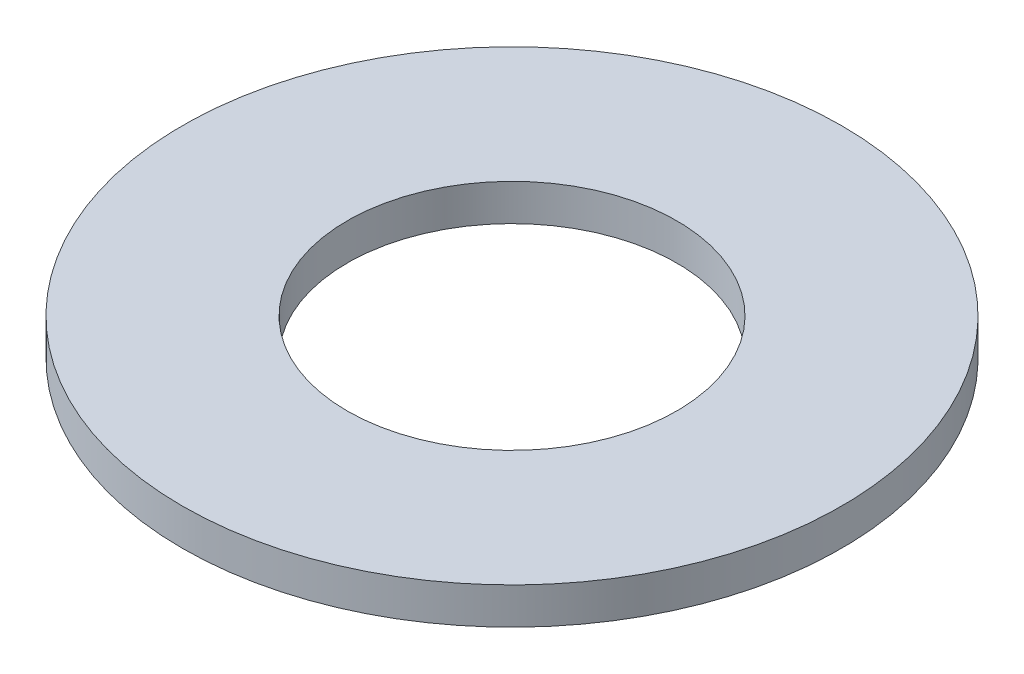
ISO-10303-21;
HEADER;
FILE_DESCRIPTION(('STEP AP214'),'2;1');
FILE_NAME('part.step','',(''),(''),'','','');
FILE_SCHEMA(('AUTOMOTIVE_DESIGN { 1 0 10303 214 1 1 1 1 }'));
ENDSEC;
DATA;
#1=APPLICATION_CONTEXT('core data for automotive mechanical design processes');
#2=APPLICATION_PROTOCOL_DEFINITION('international standard','automotive_design',2000,#1);
#3=PRODUCT_CONTEXT('',#1,'mechanical');
#4=PRODUCT('Part','Part','',(#3));
#5=PRODUCT_RELATED_PRODUCT_CATEGORY('part','',(#4));
#6=PRODUCT_DEFINITION_FORMATION('','',#4);
#7=PRODUCT_DEFINITION_CONTEXT('part definition',#1,'design');
#8=PRODUCT_DEFINITION('design','',#6,#7);
#9=PRODUCT_DEFINITION_SHAPE('','',#8);
#10=(LENGTH_UNIT() NAMED_UNIT(*) SI_UNIT(.MILLI.,.METRE.));
#11=(NAMED_UNIT(*) PLANE_ANGLE_UNIT() SI_UNIT($,.RADIAN.));
#12=(NAMED_UNIT(*) SI_UNIT($,.STERADIAN.) SOLID_ANGLE_UNIT());
#13=UNCERTAINTY_MEASURE_WITH_UNIT(LENGTH_MEASURE(1.E-05),#10,'distance_accuracy_value','');
#14=(GEOMETRIC_REPRESENTATION_CONTEXT(3) GLOBAL_UNCERTAINTY_ASSIGNED_CONTEXT((#13)) GLOBAL_UNIT_ASSIGNED_CONTEXT((#10,
#11,#12)) REPRESENTATION_CONTEXT('',''));
#15=CARTESIAN_POINT('',(0.,0.,0.));
#16=DIRECTION('',(0.,0.,1.));
#17=DIRECTION('',(1.,0.,0.));
#18=AXIS2_PLACEMENT_3D('',#15,#16,#17);
#19=CARTESIAN_POINT('',(0.,0.5,0.));
#20=DIRECTION('',(0.,-1.,0.));
#21=DIRECTION('',(0.,0.,-1.));
#22=AXIS2_PLACEMENT_3D('',#19,#20,#21);
#23=CYLINDRICAL_SURFACE('',#22,4.5);
#24=CARTESIAN_POINT('',(0.,0.5,0.));
#25=DIRECTION('',(0.,1.,0.));
#26=DIRECTION('',(0.,0.,1.));
#27=AXIS2_PLACEMENT_3D('',#24,#25,#26);
#28=CIRCLE('',#27,4.5);
#29=CARTESIAN_POINT('',(0.,0.5,4.5));
#30=VERTEX_POINT('',#29);
#31=EDGE_CURVE('E10',#30,#30,#28,.T.);
#32=ORIENTED_EDGE('',*,*,#31,.F.);
#33=EDGE_LOOP('',(#32));
#34=FACE_BOUND('',#33,.T.);
#35=CARTESIAN_POINT('',(0.,0.,0.));
#36=DIRECTION('',(0.,1.,0.));
#37=DIRECTION('',(0.,0.,1.));
#38=AXIS2_PLACEMENT_3D('',#35,#36,#37);
#39=CIRCLE('',#38,4.5);
#40=CARTESIAN_POINT('',(0.,0.,4.5));
#41=VERTEX_POINT('',#40);
#42=EDGE_CURVE('E32',#41,#41,#39,.T.);
#43=ORIENTED_EDGE('',*,*,#42,.T.);
#44=EDGE_LOOP('',(#43));
#45=FACE_BOUND('',#44,.T.);
#46=ADVANCED_FACE('F29',(#34,#45),#23,.T.);
#47=CARTESIAN_POINT('',(0.,0.5,0.));
#48=DIRECTION('',(0.,1.,0.));
#49=DIRECTION('',(0.,0.,1.));
#50=AXIS2_PLACEMENT_3D('',#47,#48,#49);
#51=PLANE('',#50);
#52=CARTESIAN_POINT('',(0.,0.5,0.));
#53=DIRECTION('',(0.,1.,0.));
#54=DIRECTION('',(0.,0.,1.));
#55=AXIS2_PLACEMENT_3D('',#52,#53,#54);
#56=CIRCLE('',#55,2.25);
#57=CARTESIAN_POINT('',(0.,0.5,2.25));
#58=VERTEX_POINT('',#57);
#59=EDGE_CURVE('E41',#58,#58,#56,.T.);
#60=ORIENTED_EDGE('',*,*,#59,.F.);
#61=EDGE_LOOP('',(#60));
#62=FACE_BOUND('',#61,.T.);
#63=ORIENTED_EDGE('',*,*,#31,.T.);
#64=EDGE_LOOP('',(#63));
#65=FACE_BOUND('',#64,.T.);
#66=ADVANCED_FACE('F56',(#62,#65),#51,.T.);
#67=CARTESIAN_POINT('',(0.,0.,0.));
#68=DIRECTION('',(0.,1.,0.));
#69=DIRECTION('',(0.,0.,1.));
#70=AXIS2_PLACEMENT_3D('',#67,#68,#69);
#71=PLANE('',#70);
#72=CARTESIAN_POINT('',(0.,0.,0.));
#73=DIRECTION('',(0.,1.,0.));
#74=DIRECTION('',(0.,0.,1.));
#75=AXIS2_PLACEMENT_3D('',#72,#73,#74);
#76=CIRCLE('',#75,2.25);
#77=CARTESIAN_POINT('',(0.,0.,2.25));
#78=VERTEX_POINT('',#77);
#79=EDGE_CURVE('E39',#78,#78,#76,.T.);
#80=ORIENTED_EDGE('',*,*,#79,.T.);
#81=EDGE_LOOP('',(#80));
#82=FACE_BOUND('',#81,.T.);
#83=ORIENTED_EDGE('',*,*,#42,.F.);
#84=EDGE_LOOP('',(#83));
#85=FACE_BOUND('',#84,.T.);
#86=ADVANCED_FACE('F47',(#82,#85),#71,.F.);
#87=CARTESIAN_POINT('',(0.,0.,0.));
#88=DIRECTION('',(0.,1.,0.));
#89=DIRECTION('',(0.,0.,1.));
#90=AXIS2_PLACEMENT_3D('',#87,#88,#89);
#91=CYLINDRICAL_SURFACE('',#90,2.25);
#92=ORIENTED_EDGE('',*,*,#79,.F.);
#93=EDGE_LOOP('',(#92));
#94=FACE_BOUND('',#93,.T.);
#95=ORIENTED_EDGE('',*,*,#59,.T.);
#96=EDGE_LOOP('',(#95));
#97=FACE_BOUND('',#96,.T.);
#98=ADVANCED_FACE('F50',(#94,#97),#91,.F.);
#99=CLOSED_SHELL('',(#46,#66,#86,#98));
#100=MANIFOLD_SOLID_BREP('B2',#99);
#101=ADVANCED_BREP_SHAPE_REPRESENTATION('',(#18,#100),#14);
#102=SHAPE_DEFINITION_REPRESENTATION(#9,#101);
ENDSEC;
END-ISO-10303-21;
